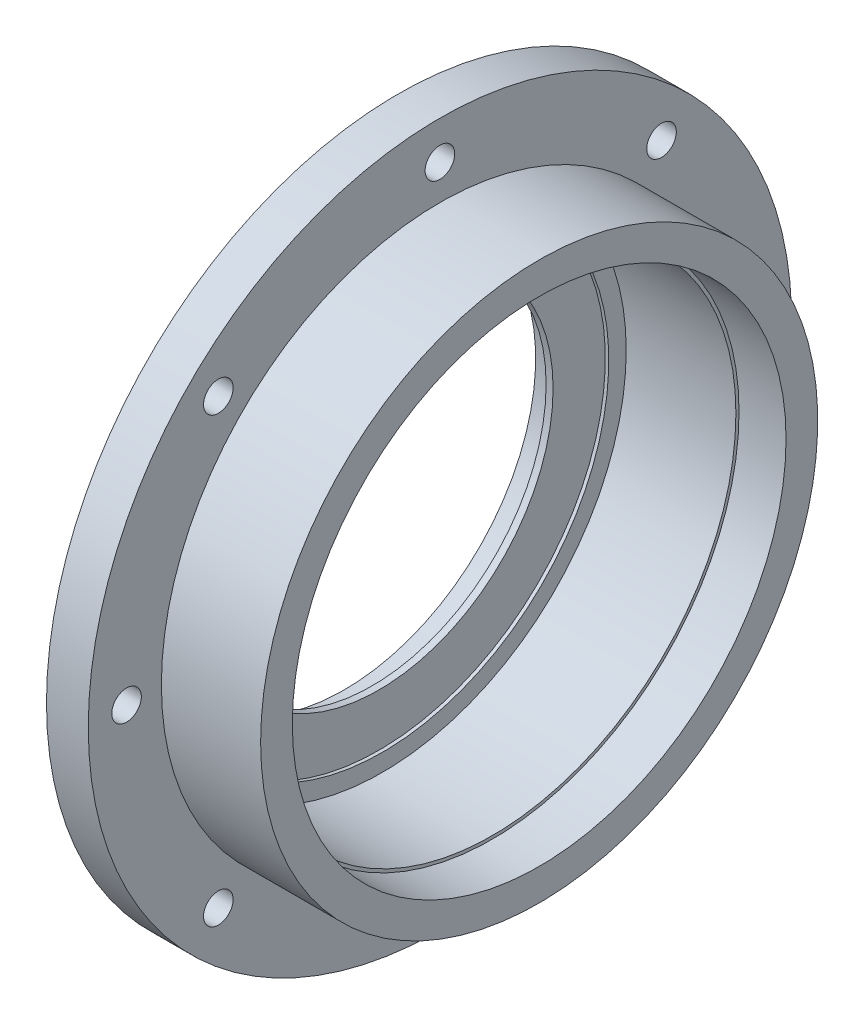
ISO-10303-21;
HEADER;
FILE_DESCRIPTION(('STEP AP214'),'2;1');
FILE_NAME('part.step','',(''),(''),'','','');
FILE_SCHEMA(('AUTOMOTIVE_DESIGN { 1 0 10303 214 1 1 1 1 }'));
ENDSEC;
DATA;
#1=APPLICATION_CONTEXT('core data for automotive mechanical design processes');
#2=APPLICATION_PROTOCOL_DEFINITION('international standard','automotive_design',2000,#1);
#3=PRODUCT_CONTEXT('',#1,'mechanical');
#4=PRODUCT('Part','Part','',(#3));
#5=PRODUCT_RELATED_PRODUCT_CATEGORY('part','',(#4));
#6=PRODUCT_DEFINITION_FORMATION('','',#4);
#7=PRODUCT_DEFINITION_CONTEXT('part definition',#1,'design');
#8=PRODUCT_DEFINITION('design','',#6,#7);
#9=PRODUCT_DEFINITION_SHAPE('','',#8);
#10=(LENGTH_UNIT() NAMED_UNIT(*) SI_UNIT(.MILLI.,.METRE.));
#11=(NAMED_UNIT(*) PLANE_ANGLE_UNIT() SI_UNIT($,.RADIAN.));
#12=(NAMED_UNIT(*) SI_UNIT($,.STERADIAN.) SOLID_ANGLE_UNIT());
#13=UNCERTAINTY_MEASURE_WITH_UNIT(LENGTH_MEASURE(1.E-05),#10,'distance_accuracy_value','');
#14=(GEOMETRIC_REPRESENTATION_CONTEXT(3) GLOBAL_UNCERTAINTY_ASSIGNED_CONTEXT((#13)) GLOBAL_UNIT_ASSIGNED_CONTEXT((#10,
#11,#12)) REPRESENTATION_CONTEXT('',''));
#15=CARTESIAN_POINT('',(0.,0.,0.));
#16=DIRECTION('',(0.,0.,1.));
#17=DIRECTION('',(1.,0.,0.));
#18=AXIS2_PLACEMENT_3D('',#15,#16,#17);
#19=CARTESIAN_POINT('',(15.5,101.,0.));
#20=DIRECTION('',(1.,0.,0.));
#21=DIRECTION('',(0.,0.,-1.));
#22=AXIS2_PLACEMENT_3D('',#19,#20,#21);
#23=PLANE('',#22);
#24=CARTESIAN_POINT('',(15.5,63.6396103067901,-63.6396103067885));
#25=DIRECTION('',(-1.,0.,0.));
#26=DIRECTION('',(0.,0.,1.));
#27=AXIS2_PLACEMENT_3D('',#24,#25,#26);
#28=CIRCLE('',#27,4.24999999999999);
#29=CARTESIAN_POINT('',(15.5,63.6396103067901,-59.3896103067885));
#30=VERTEX_POINT('',#29);
#31=EDGE_CURVE('E81',#30,#30,#28,.T.);
#32=ORIENTED_EDGE('',*,*,#31,.F.);
#33=EDGE_LOOP('',(#32));
#34=FACE_BOUND('',#33,.T.);
#35=CARTESIAN_POINT('',(15.5,9.42700507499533E-13,-90.));
#36=DIRECTION('',(-1.,0.,0.));
#37=DIRECTION('',(0.,0.,1.));
#38=AXIS2_PLACEMENT_3D('',#35,#36,#37);
#39=CIRCLE('',#38,4.24999999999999);
#40=CARTESIAN_POINT('',(15.5,9.42700507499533E-13,-85.75));
#41=VERTEX_POINT('',#40);
#42=EDGE_CURVE('E71',#41,#41,#39,.T.);
#43=ORIENTED_EDGE('',*,*,#42,.F.);
#44=EDGE_LOOP('',(#43));
#45=FACE_BOUND('',#44,.T.);
#46=CARTESIAN_POINT('',(15.5,-63.6396103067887,-63.6396103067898));
#47=DIRECTION('',(-1.,0.,0.));
#48=DIRECTION('',(0.,0.,1.));
#49=AXIS2_PLACEMENT_3D('',#46,#47,#48);
#50=CIRCLE('',#49,4.24999999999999);
#51=CARTESIAN_POINT('',(15.5,-63.6396103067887,-59.3896103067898));
#52=VERTEX_POINT('',#51);
#53=EDGE_CURVE('E68',#52,#52,#50,.T.);
#54=ORIENTED_EDGE('',*,*,#53,.F.);
#55=EDGE_LOOP('',(#54));
#56=FACE_BOUND('',#55,.T.);
#57=CARTESIAN_POINT('',(15.5,-90.,-6.28467004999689E-13));
#58=DIRECTION('',(-1.,0.,0.));
#59=DIRECTION('',(0.,0.,1.));
#60=AXIS2_PLACEMENT_3D('',#57,#58,#59);
#61=CIRCLE('',#60,4.24999999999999);
#62=CARTESIAN_POINT('',(15.5,-90.,4.24999999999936));
#63=VERTEX_POINT('',#62);
#64=EDGE_CURVE('E65',#63,#63,#61,.T.);
#65=ORIENTED_EDGE('',*,*,#64,.F.);
#66=EDGE_LOOP('',(#65));
#67=FACE_BOUND('',#66,.T.);
#68=CARTESIAN_POINT('',(15.5,-63.6396103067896,63.6396103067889));
#69=DIRECTION('',(-1.,0.,0.));
#70=DIRECTION('',(0.,0.,1.));
#71=AXIS2_PLACEMENT_3D('',#68,#69,#70);
#72=CIRCLE('',#71,4.24999999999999);
#73=CARTESIAN_POINT('',(15.5,-63.6396103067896,67.8896103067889));
#74=VERTEX_POINT('',#73);
#75=EDGE_CURVE('E61',#74,#74,#72,.T.);
#76=ORIENTED_EDGE('',*,*,#75,.F.);
#77=EDGE_LOOP('',(#76));
#78=FACE_BOUND('',#77,.T.);
#79=CARTESIAN_POINT('',(15.5,-3.14233502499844E-13,90.));
#80=DIRECTION('',(-1.,0.,0.));
#81=DIRECTION('',(0.,0.,1.));
#82=AXIS2_PLACEMENT_3D('',#79,#80,#81);
#83=CIRCLE('',#82,4.24999999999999);
#84=CARTESIAN_POINT('',(15.5,-3.14233502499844E-13,94.25));
#85=VERTEX_POINT('',#84);
#86=EDGE_CURVE('E57',#85,#85,#83,.T.);
#87=ORIENTED_EDGE('',*,*,#86,.F.);
#88=EDGE_LOOP('',(#87));
#89=FACE_BOUND('',#88,.T.);
#90=CARTESIAN_POINT('',(15.5,63.6396103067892,63.6396103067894));
#91=DIRECTION('',(-1.,0.,0.));
#92=DIRECTION('',(0.,0.,1.));
#93=AXIS2_PLACEMENT_3D('',#90,#91,#92);
#94=CIRCLE('',#93,4.24999999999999);
#95=CARTESIAN_POINT('',(15.5,63.6396103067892,67.8896103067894));
#96=VERTEX_POINT('',#95);
#97=EDGE_CURVE('E53',#96,#96,#94,.T.);
#98=ORIENTED_EDGE('',*,*,#97,.F.);
#99=EDGE_LOOP('',(#98));
#100=FACE_BOUND('',#99,.T.);
#101=CARTESIAN_POINT('',(15.5,90.,0.));
#102=DIRECTION('',(-1.,0.,0.));
#103=DIRECTION('',(0.,0.,1.));
#104=AXIS2_PLACEMENT_3D('',#101,#102,#103);
#105=CIRCLE('',#104,4.24999999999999);
#106=CARTESIAN_POINT('',(15.5,90.,4.24999999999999));
#107=VERTEX_POINT('',#106);
#108=EDGE_CURVE('E52',#107,#107,#105,.T.);
#109=ORIENTED_EDGE('',*,*,#108,.F.);
#110=EDGE_LOOP('',(#109));
#111=FACE_BOUND('',#110,.T.);
#112=CARTESIAN_POINT('',(15.5,0.,0.));
#113=DIRECTION('',(-1.,0.,0.));
#114=DIRECTION('',(0.,0.,1.));
#115=AXIS2_PLACEMENT_3D('',#112,#113,#114);
#116=CIRCLE('',#115,80.);
#117=CARTESIAN_POINT('',(15.5,0.,80.));
#118=VERTEX_POINT('',#117);
#119=EDGE_CURVE('E95',#118,#118,#116,.T.);
#120=ORIENTED_EDGE('',*,*,#119,.F.);
#121=EDGE_LOOP('',(#120));
#122=FACE_BOUND('',#121,.T.);
#123=CARTESIAN_POINT('',(15.5,0.,0.));
#124=DIRECTION('',(-1.,0.,0.));
#125=DIRECTION('',(0.,0.,1.));
#126=AXIS2_PLACEMENT_3D('',#123,#124,#125);
#127=CIRCLE('',#126,101.);
#128=CARTESIAN_POINT('',(15.5,0.,101.));
#129=VERTEX_POINT('',#128);
#130=EDGE_CURVE('E45',#129,#129,#127,.T.);
#131=ORIENTED_EDGE('',*,*,#130,.T.);
#132=EDGE_LOOP('',(#131));
#133=FACE_BOUND('',#132,.T.);
#134=ADVANCED_FACE('F33',(#34,#45,#56,#67,#78,#89,#100,#111,#122,#133),#23,.F.);
#135=CARTESIAN_POINT('',(0.,0.,0.));
#136=DIRECTION('',(-1.,0.,0.));
#137=DIRECTION('',(0.,0.,1.));
#138=AXIS2_PLACEMENT_3D('',#135,#136,#137);
#139=CYLINDRICAL_SURFACE('',#138,101.);
#140=ORIENTED_EDGE('',*,*,#130,.F.);
#141=EDGE_LOOP('',(#140));
#142=FACE_BOUND('',#141,.T.);
#143=CARTESIAN_POINT('',(27.5,0.,0.));
#144=DIRECTION('',(-1.,0.,0.));
#145=DIRECTION('',(0.,0.,1.));
#146=AXIS2_PLACEMENT_3D('',#143,#144,#145);
#147=CIRCLE('',#146,101.);
#148=CARTESIAN_POINT('',(27.5,0.,101.));
#149=VERTEX_POINT('',#148);
#150=EDGE_CURVE('E134',#149,#149,#147,.T.);
#151=ORIENTED_EDGE('',*,*,#150,.T.);
#152=EDGE_LOOP('',(#151));
#153=FACE_BOUND('',#152,.T.);
#154=ADVANCED_FACE('F160',(#142,#153),#139,.T.);
#155=CARTESIAN_POINT('',(27.5,80.,0.));
#156=DIRECTION('',(-1.,0.,0.));
#157=DIRECTION('',(0.,0.,1.));
#158=AXIS2_PLACEMENT_3D('',#155,#156,#157);
#159=PLANE('',#158);
#160=CARTESIAN_POINT('',(27.5,63.6396103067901,-63.6396103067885));
#161=DIRECTION('',(-1.,0.,0.));
#162=DIRECTION('',(0.,0.,1.));
#163=AXIS2_PLACEMENT_3D('',#160,#161,#162);
#164=CIRCLE('',#163,4.24999999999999);
#165=CARTESIAN_POINT('',(27.5,63.6396103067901,-59.3896103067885));
#166=VERTEX_POINT('',#165);
#167=EDGE_CURVE('E36',#166,#166,#164,.T.);
#168=ORIENTED_EDGE('',*,*,#167,.T.);
#169=EDGE_LOOP('',(#168));
#170=FACE_BOUND('',#169,.T.);
#171=CARTESIAN_POINT('',(27.5,9.42700507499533E-13,-90.));
#172=DIRECTION('',(-1.,0.,0.));
#173=DIRECTION('',(0.,0.,1.));
#174=AXIS2_PLACEMENT_3D('',#171,#172,#173);
#175=CIRCLE('',#174,4.24999999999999);
#176=CARTESIAN_POINT('',(27.5,9.42700507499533E-13,-85.75));
#177=VERTEX_POINT('',#176);
#178=EDGE_CURVE('E69',#177,#177,#175,.T.);
#179=ORIENTED_EDGE('',*,*,#178,.T.);
#180=EDGE_LOOP('',(#179));
#181=FACE_BOUND('',#180,.T.);
#182=CARTESIAN_POINT('',(27.5,-63.6396103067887,-63.6396103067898));
#183=DIRECTION('',(-1.,0.,0.));
#184=DIRECTION('',(0.,0.,1.));
#185=AXIS2_PLACEMENT_3D('',#182,#183,#184);
#186=CIRCLE('',#185,4.24999999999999);
#187=CARTESIAN_POINT('',(27.5,-63.6396103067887,-59.3896103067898));
#188=VERTEX_POINT('',#187);
#189=EDGE_CURVE('E66',#188,#188,#186,.T.);
#190=ORIENTED_EDGE('',*,*,#189,.T.);
#191=EDGE_LOOP('',(#190));
#192=FACE_BOUND('',#191,.T.);
#193=CARTESIAN_POINT('',(27.5,-90.,-6.28467004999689E-13));
#194=DIRECTION('',(-1.,0.,0.));
#195=DIRECTION('',(0.,0.,1.));
#196=AXIS2_PLACEMENT_3D('',#193,#194,#195);
#197=CIRCLE('',#196,4.24999999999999);
#198=CARTESIAN_POINT('',(27.5,-90.,4.24999999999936));
#199=VERTEX_POINT('',#198);
#200=EDGE_CURVE('E62',#199,#199,#197,.T.);
#201=ORIENTED_EDGE('',*,*,#200,.T.);
#202=EDGE_LOOP('',(#201));
#203=FACE_BOUND('',#202,.T.);
#204=CARTESIAN_POINT('',(27.5,-63.6396103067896,63.6396103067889));
#205=DIRECTION('',(-1.,0.,0.));
#206=DIRECTION('',(0.,0.,1.));
#207=AXIS2_PLACEMENT_3D('',#204,#205,#206);
#208=CIRCLE('',#207,4.24999999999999);
#209=CARTESIAN_POINT('',(27.5,-63.6396103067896,67.8896103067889));
#210=VERTEX_POINT('',#209);
#211=EDGE_CURVE('E58',#210,#210,#208,.T.);
#212=ORIENTED_EDGE('',*,*,#211,.T.);
#213=EDGE_LOOP('',(#212));
#214=FACE_BOUND('',#213,.T.);
#215=CARTESIAN_POINT('',(27.5,-3.14233502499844E-13,90.));
#216=DIRECTION('',(-1.,0.,0.));
#217=DIRECTION('',(0.,0.,1.));
#218=AXIS2_PLACEMENT_3D('',#215,#216,#217);
#219=CIRCLE('',#218,4.24999999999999);
#220=CARTESIAN_POINT('',(27.5,-3.14233502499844E-13,94.25));
#221=VERTEX_POINT('',#220);
#222=EDGE_CURVE('E54',#221,#221,#219,.T.);
#223=ORIENTED_EDGE('',*,*,#222,.T.);
#224=EDGE_LOOP('',(#223));
#225=FACE_BOUND('',#224,.T.);
#226=CARTESIAN_POINT('',(27.5,63.6396103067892,63.6396103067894));
#227=DIRECTION('',(-1.,0.,0.));
#228=DIRECTION('',(0.,0.,1.));
#229=AXIS2_PLACEMENT_3D('',#226,#227,#228);
#230=CIRCLE('',#229,4.24999999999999);
#231=CARTESIAN_POINT('',(27.5,63.6396103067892,67.8896103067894));
#232=VERTEX_POINT('',#231);
#233=EDGE_CURVE('E49',#232,#232,#230,.T.);
#234=ORIENTED_EDGE('',*,*,#233,.T.);
#235=EDGE_LOOP('',(#234));
#236=FACE_BOUND('',#235,.T.);
#237=CARTESIAN_POINT('',(27.5,90.,0.));
#238=DIRECTION('',(-1.,0.,0.));
#239=DIRECTION('',(0.,0.,1.));
#240=AXIS2_PLACEMENT_3D('',#237,#238,#239);
#241=CIRCLE('',#240,4.24999999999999);
#242=CARTESIAN_POINT('',(27.5,90.,4.24999999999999));
#243=VERTEX_POINT('',#242);
#244=EDGE_CURVE('E94',#243,#243,#241,.T.);
#245=ORIENTED_EDGE('',*,*,#244,.T.);
#246=EDGE_LOOP('',(#245));
#247=FACE_BOUND('',#246,.T.);
#248=ORIENTED_EDGE('',*,*,#150,.F.);
#249=EDGE_LOOP('',(#248));
#250=FACE_BOUND('',#249,.T.);
#251=CARTESIAN_POINT('',(27.5,0.,0.));
#252=DIRECTION('',(-1.,0.,0.));
#253=DIRECTION('',(0.,0.,1.));
#254=AXIS2_PLACEMENT_3D('',#251,#252,#253);
#255=CIRCLE('',#254,80.);
#256=CARTESIAN_POINT('',(27.5,0.,80.));
#257=VERTEX_POINT('',#256);
#258=EDGE_CURVE('E131',#257,#257,#255,.T.);
#259=ORIENTED_EDGE('',*,*,#258,.T.);
#260=EDGE_LOOP('',(#259));
#261=FACE_BOUND('',#260,.T.);
#262=ADVANCED_FACE('F141',(#170,#181,#192,#203,#214,#225,#236,#247,#250,#261),#159,.F.);
#263=CARTESIAN_POINT('',(0.,0.,0.));
#264=DIRECTION('',(-1.,0.,0.));
#265=DIRECTION('',(0.,0.,1.));
#266=AXIS2_PLACEMENT_3D('',#263,#264,#265);
#267=CYLINDRICAL_SURFACE('',#266,80.);
#268=ORIENTED_EDGE('',*,*,#258,.F.);
#269=EDGE_LOOP('',(#268));
#270=FACE_BOUND('',#269,.T.);
#271=CARTESIAN_POINT('',(56.,0.,0.));
#272=DIRECTION('',(-1.,0.,0.));
#273=DIRECTION('',(0.,0.,1.));
#274=AXIS2_PLACEMENT_3D('',#271,#272,#273);
#275=CIRCLE('',#274,80.);
#276=CARTESIAN_POINT('',(56.,0.,80.));
#277=VERTEX_POINT('',#276);
#278=EDGE_CURVE('E128',#277,#277,#275,.T.);
#279=ORIENTED_EDGE('',*,*,#278,.T.);
#280=EDGE_LOOP('',(#279));
#281=FACE_BOUND('',#280,.T.);
#282=ADVANCED_FACE('F189',(#270,#281),#267,.T.);
#283=CARTESIAN_POINT('',(56.,70.9,0.));
#284=DIRECTION('',(-1.,0.,0.));
#285=DIRECTION('',(0.,0.,1.));
#286=AXIS2_PLACEMENT_3D('',#283,#284,#285);
#287=PLANE('',#286);
#288=ORIENTED_EDGE('',*,*,#278,.F.);
#289=EDGE_LOOP('',(#288));
#290=FACE_BOUND('',#289,.T.);
#291=CARTESIAN_POINT('',(56.,0.,0.));
#292=DIRECTION('',(-1.,0.,0.));
#293=DIRECTION('',(0.,0.,1.));
#294=AXIS2_PLACEMENT_3D('',#291,#292,#293);
#295=CIRCLE('',#294,70.9);
#296=CARTESIAN_POINT('',(56.,0.,70.9));
#297=VERTEX_POINT('',#296);
#298=EDGE_CURVE('E125',#297,#297,#295,.T.);
#299=ORIENTED_EDGE('',*,*,#298,.T.);
#300=EDGE_LOOP('',(#299));
#301=FACE_BOUND('',#300,.T.);
#302=ADVANCED_FACE('F196',(#290,#301),#287,.F.);
#303=CARTESIAN_POINT('',(0.,0.,0.));
#304=DIRECTION('',(-1.,0.,0.));
#305=DIRECTION('',(0.,0.,1.));
#306=AXIS2_PLACEMENT_3D('',#303,#304,#305);
#307=CYLINDRICAL_SURFACE('',#306,70.9);
#308=ORIENTED_EDGE('',*,*,#298,.F.);
#309=EDGE_LOOP('',(#308));
#310=FACE_BOUND('',#309,.T.);
#311=CARTESIAN_POINT('',(42.5,0.,0.));
#312=DIRECTION('',(-1.,0.,0.));
#313=DIRECTION('',(0.,0.,1.));
#314=AXIS2_PLACEMENT_3D('',#311,#312,#313);
#315=CIRCLE('',#314,70.9);
#316=CARTESIAN_POINT('',(42.5,0.,70.9));
#317=VERTEX_POINT('',#316);
#318=EDGE_CURVE('E122',#317,#317,#315,.T.);
#319=ORIENTED_EDGE('',*,*,#318,.T.);
#320=EDGE_LOOP('',(#319));
#321=FACE_BOUND('',#320,.T.);
#322=ADVANCED_FACE('F202',(#310,#321),#307,.F.);
#323=CARTESIAN_POINT('',(42.5,70.,0.));
#324=DIRECTION('',(-1.,0.,0.));
#325=DIRECTION('',(0.,0.,1.));
#326=AXIS2_PLACEMENT_3D('',#323,#324,#325);
#327=PLANE('',#326);
#328=ORIENTED_EDGE('',*,*,#318,.F.);
#329=EDGE_LOOP('',(#328));
#330=FACE_BOUND('',#329,.T.);
#331=CARTESIAN_POINT('',(42.5,0.,0.));
#332=DIRECTION('',(-1.,0.,0.));
#333=DIRECTION('',(0.,0.,1.));
#334=AXIS2_PLACEMENT_3D('',#331,#332,#333);
#335=CIRCLE('',#334,70.);
#336=CARTESIAN_POINT('',(42.5,0.,70.));
#337=VERTEX_POINT('',#336);
#338=EDGE_CURVE('E119',#337,#337,#335,.T.);
#339=ORIENTED_EDGE('',*,*,#338,.T.);
#340=EDGE_LOOP('',(#339));
#341=FACE_BOUND('',#340,.T.);
#342=ADVANCED_FACE('F208',(#330,#341),#327,.F.);
#343=CARTESIAN_POINT('',(0.,0.,0.));
#344=DIRECTION('',(-1.,0.,0.));
#345=DIRECTION('',(0.,0.,1.));
#346=AXIS2_PLACEMENT_3D('',#343,#344,#345);
#347=CYLINDRICAL_SURFACE('',#346,70.);
#348=ORIENTED_EDGE('',*,*,#338,.F.);
#349=EDGE_LOOP('',(#348));
#350=FACE_BOUND('',#349,.T.);
#351=CARTESIAN_POINT('',(11.,0.,0.));
#352=DIRECTION('',(-1.,0.,0.));
#353=DIRECTION('',(0.,0.,1.));
#354=AXIS2_PLACEMENT_3D('',#351,#352,#353);
#355=CIRCLE('',#354,70.);
#356=CARTESIAN_POINT('',(11.,0.,70.));
#357=VERTEX_POINT('',#356);
#358=EDGE_CURVE('E116',#357,#357,#355,.T.);
#359=ORIENTED_EDGE('',*,*,#358,.T.);
#360=EDGE_LOOP('',(#359));
#361=FACE_BOUND('',#360,.T.);
#362=ADVANCED_FACE('F214',(#350,#361),#347,.F.);
#363=CARTESIAN_POINT('',(11.,65.,0.));
#364=DIRECTION('',(-1.,0.,0.));
#365=DIRECTION('',(0.,0.,1.));
#366=AXIS2_PLACEMENT_3D('',#363,#364,#365);
#367=PLANE('',#366);
#368=ORIENTED_EDGE('',*,*,#358,.F.);
#369=EDGE_LOOP('',(#368));
#370=FACE_BOUND('',#369,.T.);
#371=CARTESIAN_POINT('',(11.,0.,0.));
#372=DIRECTION('',(-1.,0.,0.));
#373=DIRECTION('',(0.,0.,1.));
#374=AXIS2_PLACEMENT_3D('',#371,#372,#373);
#375=CIRCLE('',#374,65.);
#376=CARTESIAN_POINT('',(11.,0.,65.));
#377=VERTEX_POINT('',#376);
#378=EDGE_CURVE('E113',#377,#377,#375,.T.);
#379=ORIENTED_EDGE('',*,*,#378,.T.);
#380=EDGE_LOOP('',(#379));
#381=FACE_BOUND('',#380,.T.);
#382=ADVANCED_FACE('F220',(#370,#381),#367,.F.);
#383=CARTESIAN_POINT('',(0.,0.,0.));
#384=DIRECTION('',(-1.,0.,0.));
#385=DIRECTION('',(0.,0.,1.));
#386=AXIS2_PLACEMENT_3D('',#383,#384,#385);
#387=CYLINDRICAL_SURFACE('',#386,65.);
#388=ORIENTED_EDGE('',*,*,#378,.F.);
#389=EDGE_LOOP('',(#388));
#390=FACE_BOUND('',#389,.T.);
#391=CARTESIAN_POINT('',(10.,0.,0.));
#392=DIRECTION('',(-1.,0.,0.));
#393=DIRECTION('',(0.,0.,1.));
#394=AXIS2_PLACEMENT_3D('',#391,#392,#393);
#395=CIRCLE('',#394,65.);
#396=CARTESIAN_POINT('',(10.,0.,65.));
#397=VERTEX_POINT('',#396);
#398=EDGE_CURVE('E110',#397,#397,#395,.T.);
#399=ORIENTED_EDGE('',*,*,#398,.T.);
#400=EDGE_LOOP('',(#399));
#401=FACE_BOUND('',#400,.T.);
#402=ADVANCED_FACE('F226',(#390,#401),#387,.F.);
#403=CARTESIAN_POINT('',(10.,50.,0.));
#404=DIRECTION('',(-1.,0.,0.));
#405=DIRECTION('',(0.,0.,1.));
#406=AXIS2_PLACEMENT_3D('',#403,#404,#405);
#407=PLANE('',#406);
#408=ORIENTED_EDGE('',*,*,#398,.F.);
#409=EDGE_LOOP('',(#408));
#410=FACE_BOUND('',#409,.T.);
#411=CARTESIAN_POINT('',(10.,0.,0.));
#412=DIRECTION('',(-1.,0.,0.));
#413=DIRECTION('',(0.,0.,1.));
#414=AXIS2_PLACEMENT_3D('',#411,#412,#413);
#415=CIRCLE('',#414,50.);
#416=CARTESIAN_POINT('',(10.,0.,50.));
#417=VERTEX_POINT('',#416);
#418=EDGE_CURVE('E107',#417,#417,#415,.T.);
#419=ORIENTED_EDGE('',*,*,#418,.T.);
#420=EDGE_LOOP('',(#419));
#421=FACE_BOUND('',#420,.T.);
#422=ADVANCED_FACE('F232',(#410,#421),#407,.F.);
#423=CARTESIAN_POINT('',(0.,0.,0.));
#424=DIRECTION('',(-1.,0.,0.));
#425=DIRECTION('',(0.,0.,1.));
#426=AXIS2_PLACEMENT_3D('',#423,#424,#425);
#427=CYLINDRICAL_SURFACE('',#426,50.);
#428=ORIENTED_EDGE('',*,*,#418,.F.);
#429=EDGE_LOOP('',(#428));
#430=FACE_BOUND('',#429,.T.);
#431=CARTESIAN_POINT('',(8.00000000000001,0.,0.));
#432=DIRECTION('',(-1.,0.,0.));
#433=DIRECTION('',(0.,0.,1.));
#434=AXIS2_PLACEMENT_3D('',#431,#432,#433);
#435=CIRCLE('',#434,50.);
#436=CARTESIAN_POINT('',(8.00000000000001,0.,50.));
#437=VERTEX_POINT('',#436);
#438=EDGE_CURVE('E104',#437,#437,#435,.T.);
#439=ORIENTED_EDGE('',*,*,#438,.T.);
#440=EDGE_LOOP('',(#439));
#441=FACE_BOUND('',#440,.T.);
#442=ADVANCED_FACE('F238',(#430,#441),#427,.F.);
#443=CARTESIAN_POINT('',(8.00000000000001,55.,0.));
#444=DIRECTION('',(1.,0.,0.));
#445=DIRECTION('',(0.,0.,-1.));
#446=AXIS2_PLACEMENT_3D('',#443,#444,#445);
#447=PLANE('',#446);
#448=ORIENTED_EDGE('',*,*,#438,.F.);
#449=EDGE_LOOP('',(#448));
#450=FACE_BOUND('',#449,.T.);
#451=CARTESIAN_POINT('',(8.00000000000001,0.,0.));
#452=DIRECTION('',(-1.,0.,0.));
#453=DIRECTION('',(0.,0.,1.));
#454=AXIS2_PLACEMENT_3D('',#451,#452,#453);
#455=CIRCLE('',#454,55.);
#456=CARTESIAN_POINT('',(8.00000000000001,0.,55.));
#457=VERTEX_POINT('',#456);
#458=EDGE_CURVE('E101',#457,#457,#455,.T.);
#459=ORIENTED_EDGE('',*,*,#458,.T.);
#460=EDGE_LOOP('',(#459));
#461=FACE_BOUND('',#460,.T.);
#462=ADVANCED_FACE('F244',(#450,#461),#447,.F.);
#463=CARTESIAN_POINT('',(0.,0.,0.));
#464=DIRECTION('',(-1.,0.,0.));
#465=DIRECTION('',(0.,0.,1.));
#466=AXIS2_PLACEMENT_3D('',#463,#464,#465);
#467=CYLINDRICAL_SURFACE('',#466,55.);
#468=ORIENTED_EDGE('',*,*,#458,.F.);
#469=EDGE_LOOP('',(#468));
#470=FACE_BOUND('',#469,.T.);
#471=CARTESIAN_POINT('',(0.,0.,0.));
#472=DIRECTION('',(-1.,0.,0.));
#473=DIRECTION('',(0.,0.,1.));
#474=AXIS2_PLACEMENT_3D('',#471,#472,#473);
#475=CIRCLE('',#474,55.);
#476=CARTESIAN_POINT('',(0.,0.,55.));
#477=VERTEX_POINT('',#476);
#478=EDGE_CURVE('E98',#477,#477,#475,.T.);
#479=ORIENTED_EDGE('',*,*,#478,.T.);
#480=EDGE_LOOP('',(#479));
#481=FACE_BOUND('',#480,.T.);
#482=ADVANCED_FACE('F250',(#470,#481),#467,.F.);
#483=CARTESIAN_POINT('',(0.,80.,0.));
#484=DIRECTION('',(1.,0.,0.));
#485=DIRECTION('',(0.,0.,-1.));
#486=AXIS2_PLACEMENT_3D('',#483,#484,#485);
#487=PLANE('',#486);
#488=CARTESIAN_POINT('',(0.,0.,0.));
#489=DIRECTION('',(1.,0.,0.));
#490=DIRECTION('',(0.,0.,-1.));
#491=AXIS2_PLACEMENT_3D('',#488,#489,#490);
#492=CIRCLE('',#491,74.9999999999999);
#493=CARTESIAN_POINT('',(0.,0.,-74.9999999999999));
#494=VERTEX_POINT('',#493);
#495=EDGE_CURVE('E40',#494,#494,#492,.F.);
#496=ORIENTED_EDGE('',*,*,#495,.T.);
#497=EDGE_LOOP('',(#496));
#498=FACE_BOUND('',#497,.T.);
#499=ORIENTED_EDGE('',*,*,#478,.F.);
#500=EDGE_LOOP('',(#499));
#501=FACE_BOUND('',#500,.T.);
#502=ADVANCED_FACE('F157',(#498,#501),#487,.F.);
#503=CARTESIAN_POINT('',(0.,0.,0.));
#504=DIRECTION('',(-1.,0.,0.));
#505=DIRECTION('',(0.,0.,1.));
#506=AXIS2_PLACEMENT_3D('',#503,#504,#505);
#507=CYLINDRICAL_SURFACE('',#506,80.);
#508=CARTESIAN_POINT('',(5.00000000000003,0.,0.));
#509=DIRECTION('',(1.,0.,0.));
#510=DIRECTION('',(0.,0.,-1.));
#511=AXIS2_PLACEMENT_3D('',#508,#509,#510);
#512=CIRCLE('',#511,80.);
#513=CARTESIAN_POINT('',(5.00000000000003,0.,-80.));
#514=VERTEX_POINT('',#513);
#515=EDGE_CURVE('E10',#514,#514,#512,.T.);
#516=ORIENTED_EDGE('',*,*,#515,.T.);
#517=EDGE_LOOP('',(#516));
#518=FACE_BOUND('',#517,.T.);
#519=ORIENTED_EDGE('',*,*,#119,.T.);
#520=EDGE_LOOP('',(#519));
#521=FACE_BOUND('',#520,.T.);
#522=ADVANCED_FACE('F147',(#518,#521),#507,.T.);
#523=CARTESIAN_POINT('',(15.5,90.,0.));
#524=DIRECTION('',(-1.,0.,0.));
#525=DIRECTION('',(0.,0.,1.));
#526=AXIS2_PLACEMENT_3D('',#523,#524,#525);
#527=CYLINDRICAL_SURFACE('',#526,4.24999999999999);
#528=ORIENTED_EDGE('',*,*,#108,.T.);
#529=EDGE_LOOP('',(#528));
#530=FACE_BOUND('',#529,.T.);
#531=ORIENTED_EDGE('',*,*,#244,.F.);
#532=EDGE_LOOP('',(#531));
#533=FACE_BOUND('',#532,.T.);
#534=ADVANCED_FACE('F144',(#530,#533),#527,.F.);
#535=CARTESIAN_POINT('',(0.,0.,0.));
#536=DIRECTION('',(1.,0.,0.));
#537=DIRECTION('',(0.,0.,-1.));
#538=AXIS2_PLACEMENT_3D('',#535,#536,#537);
#539=CONICAL_SURFACE('',#538,74.9999999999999,0.785398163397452);
#540=ORIENTED_EDGE('',*,*,#515,.F.);
#541=EDGE_LOOP('',(#540));
#542=FACE_BOUND('',#541,.T.);
#543=ORIENTED_EDGE('',*,*,#495,.F.);
#544=EDGE_LOOP('',(#543));
#545=FACE_BOUND('',#544,.T.);
#546=ADVANCED_FACE('F146',(#542,#545),#539,.T.);
#547=CARTESIAN_POINT('',(15.5,63.6396103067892,63.6396103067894));
#548=DIRECTION('',(-1.,0.,0.));
#549=DIRECTION('',(0.,0.,1.));
#550=AXIS2_PLACEMENT_3D('',#547,#548,#549);
#551=CYLINDRICAL_SURFACE('',#550,4.24999999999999);
#552=ORIENTED_EDGE('',*,*,#97,.T.);
#553=EDGE_LOOP('',(#552));
#554=FACE_BOUND('',#553,.T.);
#555=ORIENTED_EDGE('',*,*,#233,.F.);
#556=EDGE_LOOP('',(#555));
#557=FACE_BOUND('',#556,.T.);
#558=ADVANCED_FACE('F154',(#554,#557),#551,.F.);
#559=CARTESIAN_POINT('',(15.5,-3.14233502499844E-13,90.));
#560=DIRECTION('',(-1.,0.,0.));
#561=DIRECTION('',(0.,0.,1.));
#562=AXIS2_PLACEMENT_3D('',#559,#560,#561);
#563=CYLINDRICAL_SURFACE('',#562,4.24999999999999);
#564=ORIENTED_EDGE('',*,*,#86,.T.);
#565=EDGE_LOOP('',(#564));
#566=FACE_BOUND('',#565,.T.);
#567=ORIENTED_EDGE('',*,*,#222,.F.);
#568=EDGE_LOOP('',(#567));
#569=FACE_BOUND('',#568,.T.);
#570=ADVANCED_FACE('F300',(#566,#569),#563,.F.);
#571=CARTESIAN_POINT('',(15.5,-63.6396103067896,63.6396103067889));
#572=DIRECTION('',(-1.,0.,0.));
#573=DIRECTION('',(0.,0.,1.));
#574=AXIS2_PLACEMENT_3D('',#571,#572,#573);
#575=CYLINDRICAL_SURFACE('',#574,4.24999999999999);
#576=ORIENTED_EDGE('',*,*,#75,.T.);
#577=EDGE_LOOP('',(#576));
#578=FACE_BOUND('',#577,.T.);
#579=ORIENTED_EDGE('',*,*,#211,.F.);
#580=EDGE_LOOP('',(#579));
#581=FACE_BOUND('',#580,.T.);
#582=ADVANCED_FACE('F310',(#578,#581),#575,.F.);
#583=CARTESIAN_POINT('',(15.5,-90.,-6.28467004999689E-13));
#584=DIRECTION('',(-1.,0.,0.));
#585=DIRECTION('',(0.,0.,1.));
#586=AXIS2_PLACEMENT_3D('',#583,#584,#585);
#587=CYLINDRICAL_SURFACE('',#586,4.24999999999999);
#588=ORIENTED_EDGE('',*,*,#64,.T.);
#589=EDGE_LOOP('',(#588));
#590=FACE_BOUND('',#589,.T.);
#591=ORIENTED_EDGE('',*,*,#200,.F.);
#592=EDGE_LOOP('',(#591));
#593=FACE_BOUND('',#592,.T.);
#594=ADVANCED_FACE('F320',(#590,#593),#587,.F.);
#595=CARTESIAN_POINT('',(15.5,-63.6396103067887,-63.6396103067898));
#596=DIRECTION('',(-1.,0.,0.));
#597=DIRECTION('',(0.,0.,1.));
#598=AXIS2_PLACEMENT_3D('',#595,#596,#597);
#599=CYLINDRICAL_SURFACE('',#598,4.24999999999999);
#600=ORIENTED_EDGE('',*,*,#53,.T.);
#601=EDGE_LOOP('',(#600));
#602=FACE_BOUND('',#601,.T.);
#603=ORIENTED_EDGE('',*,*,#189,.F.);
#604=EDGE_LOOP('',(#603));
#605=FACE_BOUND('',#604,.T.);
#606=ADVANCED_FACE('F330',(#602,#605),#599,.F.);
#607=CARTESIAN_POINT('',(15.5,9.42700507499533E-13,-90.));
#608=DIRECTION('',(-1.,0.,0.));
#609=DIRECTION('',(0.,0.,1.));
#610=AXIS2_PLACEMENT_3D('',#607,#608,#609);
#611=CYLINDRICAL_SURFACE('',#610,4.24999999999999);
#612=ORIENTED_EDGE('',*,*,#42,.T.);
#613=EDGE_LOOP('',(#612));
#614=FACE_BOUND('',#613,.T.);
#615=ORIENTED_EDGE('',*,*,#178,.F.);
#616=EDGE_LOOP('',(#615));
#617=FACE_BOUND('',#616,.T.);
#618=ADVANCED_FACE('F340',(#614,#617),#611,.F.);
#619=CARTESIAN_POINT('',(15.5,63.6396103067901,-63.6396103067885));
#620=DIRECTION('',(-1.,0.,0.));
#621=DIRECTION('',(0.,0.,1.));
#622=AXIS2_PLACEMENT_3D('',#619,#620,#621);
#623=CYLINDRICAL_SURFACE('',#622,4.24999999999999);
#624=ORIENTED_EDGE('',*,*,#31,.T.);
#625=EDGE_LOOP('',(#624));
#626=FACE_BOUND('',#625,.T.);
#627=ORIENTED_EDGE('',*,*,#167,.F.);
#628=EDGE_LOOP('',(#627));
#629=FACE_BOUND('',#628,.T.);
#630=ADVANCED_FACE('F350',(#626,#629),#623,.F.);
#631=CLOSED_SHELL('',(#134,#154,#262,#282,#302,#322,#342,#362,#382,#402,#422,#442,#462,#482,
#502,#522,#534,#546,#558,#570,#582,#594,#606,#618,#630));
#632=MANIFOLD_SOLID_BREP('B2',#631);
#633=ADVANCED_BREP_SHAPE_REPRESENTATION('',(#18,#632),#14);
#634=SHAPE_DEFINITION_REPRESENTATION(#9,#633);
ENDSEC;
END-ISO-10303-21;
